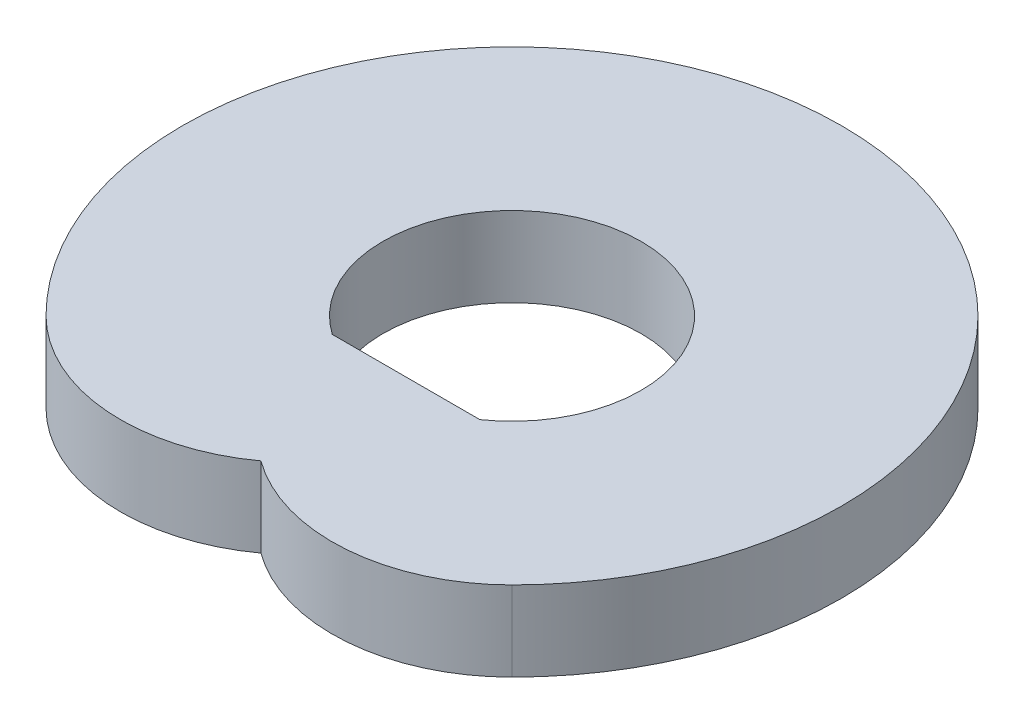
ISO-10303-21;
HEADER;
FILE_DESCRIPTION(('STEP AP214'),'2;1');
FILE_NAME('part.step','',(''),(''),'','','');
FILE_SCHEMA(('AUTOMOTIVE_DESIGN { 1 0 10303 214 1 1 1 1 }'));
ENDSEC;
DATA;
#1=APPLICATION_CONTEXT('core data for automotive mechanical design processes');
#2=APPLICATION_PROTOCOL_DEFINITION('international standard','automotive_design',2000,#1);
#3=PRODUCT_CONTEXT('',#1,'mechanical');
#4=PRODUCT('Part','Part','',(#3));
#5=PRODUCT_RELATED_PRODUCT_CATEGORY('part','',(#4));
#6=PRODUCT_DEFINITION_FORMATION('','',#4);
#7=PRODUCT_DEFINITION_CONTEXT('part definition',#1,'design');
#8=PRODUCT_DEFINITION('design','',#6,#7);
#9=PRODUCT_DEFINITION_SHAPE('','',#8);
#10=(LENGTH_UNIT() NAMED_UNIT(*) SI_UNIT(.MILLI.,.METRE.));
#11=(NAMED_UNIT(*) PLANE_ANGLE_UNIT() SI_UNIT($,.RADIAN.));
#12=(NAMED_UNIT(*) SI_UNIT($,.STERADIAN.) SOLID_ANGLE_UNIT());
#13=UNCERTAINTY_MEASURE_WITH_UNIT(LENGTH_MEASURE(1.E-05),#10,'distance_accuracy_value','');
#14=(GEOMETRIC_REPRESENTATION_CONTEXT(3) GLOBAL_UNCERTAINTY_ASSIGNED_CONTEXT((#13)) GLOBAL_UNIT_ASSIGNED_CONTEXT((#10,
#11,#12)) REPRESENTATION_CONTEXT('',''));
#15=CARTESIAN_POINT('',(0.,0.,0.));
#16=DIRECTION('',(0.,0.,1.));
#17=DIRECTION('',(1.,0.,0.));
#18=AXIS2_PLACEMENT_3D('',#15,#16,#17);
#19=CARTESIAN_POINT('',(132.582521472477,200.,132.582521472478));
#20=DIRECTION('',(0.,1.,0.));
#21=DIRECTION('',(0.,0.,1.));
#22=AXIS2_PLACEMENT_3D('',#19,#20,#21);
#23=PLANE('',#22);
#24=CARTESIAN_POINT('',(265.165042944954,200.,265.165042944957));
#25=DIRECTION('',(0.,1.,0.));
#26=DIRECTION('',(0.,0.,1.));
#27=AXIS2_PLACEMENT_3D('',#24,#25,#26);
#28=CIRCLE('',#27,450.);
#29=CARTESIAN_POINT('',(3.33066907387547E-13,200.,628.741032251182));
#30=VERTEX_POINT('',#29);
#31=CARTESIAN_POINT('',(583.363094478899,200.,583.363094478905));
#32=VERTEX_POINT('',#31);
#33=EDGE_CURVE('E96',#30,#32,#28,.T.);
#34=ORIENTED_EDGE('',*,*,#33,.T.);
#35=CARTESIAN_POINT('',(0.,200.,0.));
#36=DIRECTION('',(0.,1.,0.));
#37=DIRECTION('',(0.,0.,1.));
#38=AXIS2_PLACEMENT_3D('',#35,#36,#37);
#39=CIRCLE('',#38,825.);
#40=CARTESIAN_POINT('',(-583.363094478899,200.,583.363094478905));
#41=VERTEX_POINT('',#40);
#42=EDGE_CURVE('E99',#32,#41,#39,.T.);
#43=ORIENTED_EDGE('',*,*,#42,.T.);
#44=CARTESIAN_POINT('',(-265.165042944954,200.,265.165042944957));
#45=DIRECTION('',(0.,1.,0.));
#46=DIRECTION('',(0.,0.,1.));
#47=AXIS2_PLACEMENT_3D('',#44,#45,#46);
#48=CIRCLE('',#47,450.);
#49=EDGE_CURVE('E102',#41,#30,#48,.T.);
#50=ORIENTED_EDGE('',*,*,#49,.T.);
#51=EDGE_LOOP('',(#34,#43,#50));
#52=FACE_BOUND('',#51,.T.);
#53=DIRECTION('',(1.,0.,0.));
#54=VECTOR('',#53,1.);
#55=CARTESIAN_POINT('',(184.834957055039,200.,265.165042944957));
#56=LINE('',#55,#54);
#57=CARTESIAN_POINT('',(-184.83495705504,200.,265.165042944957));
#58=VERTEX_POINT('',#57);
#59=CARTESIAN_POINT('',(184.834957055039,200.,265.165042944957));
#60=VERTEX_POINT('',#59);
#61=EDGE_CURVE('E79',#58,#60,#56,.T.);
#62=ORIENTED_EDGE('',*,*,#61,.F.);
#63=CARTESIAN_POINT('',(0.,200.,0.));
#64=DIRECTION('',(0.,1.,0.));
#65=DIRECTION('',(0.,0.,1.));
#66=AXIS2_PLACEMENT_3D('',#63,#64,#65);
#67=CIRCLE('',#66,323.228187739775);
#68=EDGE_CURVE('E85',#60,#58,#67,.T.);
#69=ORIENTED_EDGE('',*,*,#68,.F.);
#70=EDGE_LOOP('',(#62,#69));
#71=FACE_BOUND('',#70,.T.);
#72=ADVANCED_FACE('F33',(#52,#71),#23,.T.);
#73=CARTESIAN_POINT('',(132.582521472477,0.,132.582521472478));
#74=DIRECTION('',(0.,1.,0.));
#75=DIRECTION('',(0.,0.,1.));
#76=AXIS2_PLACEMENT_3D('',#73,#74,#75);
#77=PLANE('',#76);
#78=CARTESIAN_POINT('',(265.165042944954,0.,265.165042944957));
#79=DIRECTION('',(0.,1.,0.));
#80=DIRECTION('',(0.,0.,1.));
#81=AXIS2_PLACEMENT_3D('',#78,#79,#80);
#82=CIRCLE('',#81,450.);
#83=CARTESIAN_POINT('',(3.33066907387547E-13,0.,628.741032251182));
#84=VERTEX_POINT('',#83);
#85=CARTESIAN_POINT('',(583.363094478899,0.,583.363094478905));
#86=VERTEX_POINT('',#85);
#87=EDGE_CURVE('E95',#84,#86,#82,.T.);
#88=ORIENTED_EDGE('',*,*,#87,.F.);
#89=CARTESIAN_POINT('',(-265.165042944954,0.,265.165042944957));
#90=DIRECTION('',(0.,1.,0.));
#91=DIRECTION('',(0.,0.,1.));
#92=AXIS2_PLACEMENT_3D('',#89,#90,#91);
#93=CIRCLE('',#92,450.);
#94=CARTESIAN_POINT('',(-583.363094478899,0.,583.363094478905));
#95=VERTEX_POINT('',#94);
#96=EDGE_CURVE('E100',#95,#84,#93,.T.);
#97=ORIENTED_EDGE('',*,*,#96,.F.);
#98=CARTESIAN_POINT('',(0.,0.,0.));
#99=DIRECTION('',(0.,1.,0.));
#100=DIRECTION('',(0.,0.,1.));
#101=AXIS2_PLACEMENT_3D('',#98,#99,#100);
#102=CIRCLE('',#101,825.);
#103=EDGE_CURVE('E107',#86,#95,#102,.T.);
#104=ORIENTED_EDGE('',*,*,#103,.F.);
#105=EDGE_LOOP('',(#88,#97,#104));
#106=FACE_BOUND('',#105,.T.);
#107=CARTESIAN_POINT('',(0.,0.,0.));
#108=DIRECTION('',(0.,1.,0.));
#109=DIRECTION('',(0.,0.,1.));
#110=AXIS2_PLACEMENT_3D('',#107,#108,#109);
#111=CIRCLE('',#110,323.228187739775);
#112=CARTESIAN_POINT('',(184.834957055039,0.,265.165042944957));
#113=VERTEX_POINT('',#112);
#114=CARTESIAN_POINT('',(-184.834957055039,0.,265.165042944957));
#115=VERTEX_POINT('',#114);
#116=EDGE_CURVE('E55',#113,#115,#111,.T.);
#117=ORIENTED_EDGE('',*,*,#116,.T.);
#118=DIRECTION('',(1.,0.,0.));
#119=VECTOR('',#118,1.);
#120=CARTESIAN_POINT('',(184.834957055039,0.,265.165042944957));
#121=LINE('',#120,#119);
#122=EDGE_CURVE('E89',#115,#113,#121,.T.);
#123=ORIENTED_EDGE('',*,*,#122,.T.);
#124=EDGE_LOOP('',(#117,#123));
#125=FACE_BOUND('',#124,.T.);
#126=ADVANCED_FACE('F121',(#106,#125),#77,.F.);
#127=CARTESIAN_POINT('',(265.165042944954,200.,265.165042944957));
#128=DIRECTION('',(0.,-1.,0.));
#129=DIRECTION('',(0.,0.,-1.));
#130=AXIS2_PLACEMENT_3D('',#127,#128,#129);
#131=CYLINDRICAL_SURFACE('',#130,450.);
#132=ORIENTED_EDGE('',*,*,#87,.T.);
#133=DIRECTION('',(0.,-1.,0.));
#134=VECTOR('',#133,1.);
#135=CARTESIAN_POINT('',(583.363094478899,200.,583.363094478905));
#136=LINE('',#135,#134);
#137=EDGE_CURVE('E11',#32,#86,#136,.T.);
#138=ORIENTED_EDGE('',*,*,#137,.F.);
#139=ORIENTED_EDGE('',*,*,#33,.F.);
#140=DIRECTION('',(0.,-1.,0.));
#141=VECTOR('',#140,1.);
#142=CARTESIAN_POINT('',(3.33066907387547E-13,200.,628.741032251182));
#143=LINE('',#142,#141);
#144=EDGE_CURVE('E104',#30,#84,#143,.T.);
#145=ORIENTED_EDGE('',*,*,#144,.T.);
#146=EDGE_LOOP('',(#132,#138,#139,#145));
#147=FACE_BOUND('',#146,.T.);
#148=ADVANCED_FACE('F35',(#147),#131,.T.);
#149=CARTESIAN_POINT('',(0.,200.,0.));
#150=DIRECTION('',(0.,-1.,0.));
#151=DIRECTION('',(0.,0.,-1.));
#152=AXIS2_PLACEMENT_3D('',#149,#150,#151);
#153=CYLINDRICAL_SURFACE('',#152,825.);
#154=ORIENTED_EDGE('',*,*,#103,.T.);
#155=DIRECTION('',(0.,-1.,0.));
#156=VECTOR('',#155,1.);
#157=CARTESIAN_POINT('',(-583.363094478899,200.,583.363094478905));
#158=LINE('',#157,#156);
#159=EDGE_CURVE('E41',#41,#95,#158,.T.);
#160=ORIENTED_EDGE('',*,*,#159,.F.);
#161=ORIENTED_EDGE('',*,*,#42,.F.);
#162=ORIENTED_EDGE('',*,*,#137,.T.);
#163=EDGE_LOOP('',(#154,#160,#161,#162));
#164=FACE_BOUND('',#163,.T.);
#165=ADVANCED_FACE('F127',(#164),#153,.T.);
#166=CARTESIAN_POINT('',(-265.165042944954,200.,265.165042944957));
#167=DIRECTION('',(0.,-1.,0.));
#168=DIRECTION('',(0.,0.,-1.));
#169=AXIS2_PLACEMENT_3D('',#166,#167,#168);
#170=CYLINDRICAL_SURFACE('',#169,450.);
#171=ORIENTED_EDGE('',*,*,#96,.T.);
#172=ORIENTED_EDGE('',*,*,#144,.F.);
#173=ORIENTED_EDGE('',*,*,#49,.F.);
#174=ORIENTED_EDGE('',*,*,#159,.T.);
#175=EDGE_LOOP('',(#171,#172,#173,#174));
#176=FACE_BOUND('',#175,.T.);
#177=ADVANCED_FACE('F116',(#176),#170,.T.);
#178=CARTESIAN_POINT('',(0.,200.,0.));
#179=DIRECTION('',(0.,-1.,0.));
#180=DIRECTION('',(0.,0.,-1.));
#181=AXIS2_PLACEMENT_3D('',#178,#179,#180);
#182=CYLINDRICAL_SURFACE('',#181,323.228187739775);
#183=ORIENTED_EDGE('',*,*,#116,.F.);
#184=DIRECTION('',(0.,-1.,0.));
#185=VECTOR('',#184,1.);
#186=CARTESIAN_POINT('',(184.834957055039,200.,265.165042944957));
#187=LINE('',#186,#185);
#188=EDGE_CURVE('E81',#60,#113,#187,.T.);
#189=ORIENTED_EDGE('',*,*,#188,.F.);
#190=ORIENTED_EDGE('',*,*,#68,.T.);
#191=DIRECTION('',(0.,-1.,0.));
#192=VECTOR('',#191,1.);
#193=CARTESIAN_POINT('',(-184.834957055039,200.,265.165042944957));
#194=LINE('',#193,#192);
#195=EDGE_CURVE('E48',#58,#115,#194,.T.);
#196=ORIENTED_EDGE('',*,*,#195,.T.);
#197=EDGE_LOOP('',(#183,#189,#190,#196));
#198=FACE_BOUND('',#197,.T.);
#199=ADVANCED_FACE('F87',(#198),#182,.F.);
#200=CARTESIAN_POINT('',(184.834957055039,200.,265.165042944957));
#201=DIRECTION('',(0.,0.,-1.));
#202=DIRECTION('',(-1.,0.,0.));
#203=AXIS2_PLACEMENT_3D('',#200,#201,#202);
#204=PLANE('',#203);
#205=ORIENTED_EDGE('',*,*,#122,.F.);
#206=ORIENTED_EDGE('',*,*,#195,.F.);
#207=ORIENTED_EDGE('',*,*,#61,.T.);
#208=ORIENTED_EDGE('',*,*,#188,.T.);
#209=EDGE_LOOP('',(#205,#206,#207,#208));
#210=FACE_BOUND('',#209,.T.);
#211=ADVANCED_FACE('F80',(#210),#204,.T.);
#212=CLOSED_SHELL('',(#72,#126,#148,#165,#177,#199,#211));
#213=MANIFOLD_SOLID_BREP('B2',#212);
#214=ADVANCED_BREP_SHAPE_REPRESENTATION('',(#18,#213),#14);
#215=SHAPE_DEFINITION_REPRESENTATION(#9,#214);
ENDSEC;
END-ISO-10303-21;
